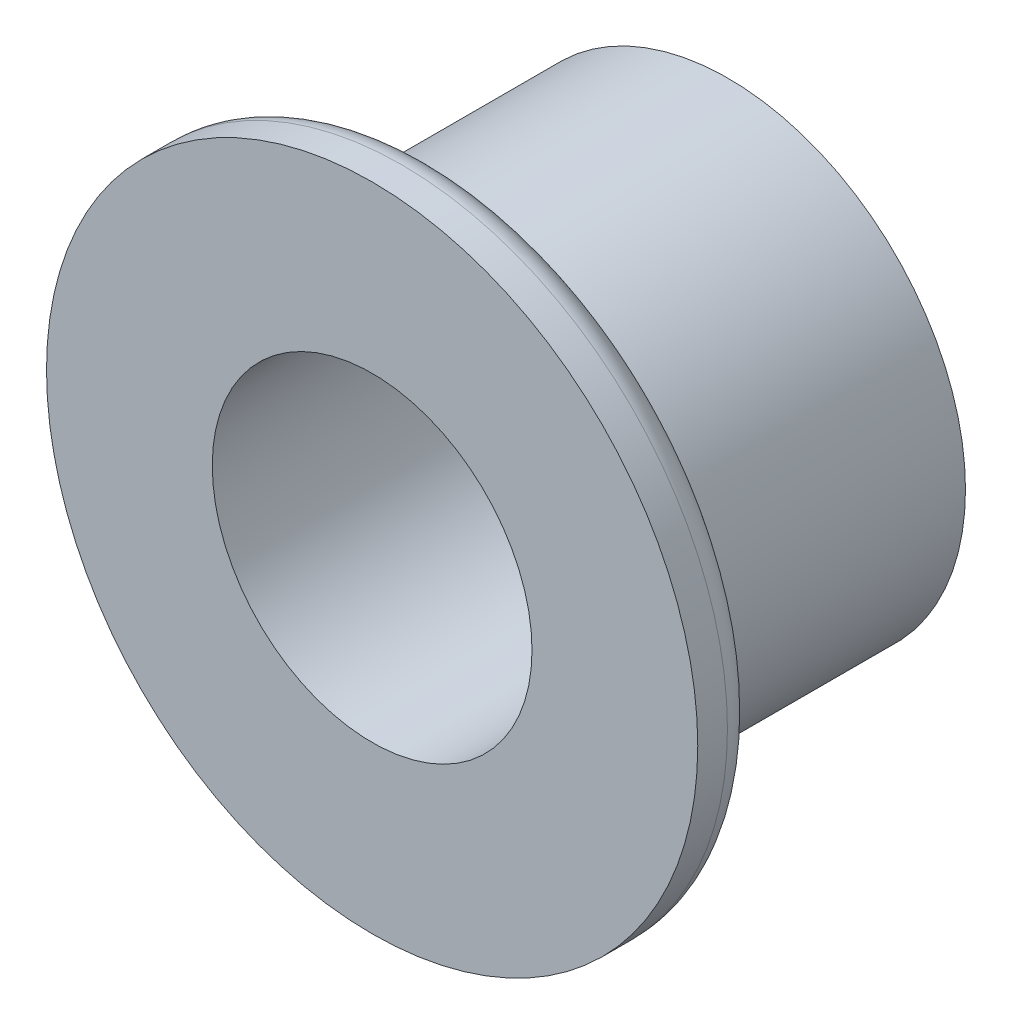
ISO-10303-21;
HEADER;
FILE_DESCRIPTION(('STEP AP214'),'2;1');
FILE_NAME('part.step','',(''),(''),'','','');
FILE_SCHEMA(('AUTOMOTIVE_DESIGN { 1 0 10303 214 1 1 1 1 }'));
ENDSEC;
DATA;
#1=APPLICATION_CONTEXT('core data for automotive mechanical design processes');
#2=APPLICATION_PROTOCOL_DEFINITION('international standard','automotive_design',2000,#1);
#3=PRODUCT_CONTEXT('',#1,'mechanical');
#4=PRODUCT('Part','Part','',(#3));
#5=PRODUCT_RELATED_PRODUCT_CATEGORY('part','',(#4));
#6=PRODUCT_DEFINITION_FORMATION('','',#4);
#7=PRODUCT_DEFINITION_CONTEXT('part definition',#1,'design');
#8=PRODUCT_DEFINITION('design','',#6,#7);
#9=PRODUCT_DEFINITION_SHAPE('','',#8);
#10=(LENGTH_UNIT() NAMED_UNIT(*) SI_UNIT(.MILLI.,.METRE.));
#11=(NAMED_UNIT(*) PLANE_ANGLE_UNIT() SI_UNIT($,.RADIAN.));
#12=(NAMED_UNIT(*) SI_UNIT($,.STERADIAN.) SOLID_ANGLE_UNIT());
#13=UNCERTAINTY_MEASURE_WITH_UNIT(LENGTH_MEASURE(1.E-05),#10,'distance_accuracy_value','');
#14=(GEOMETRIC_REPRESENTATION_CONTEXT(3) GLOBAL_UNCERTAINTY_ASSIGNED_CONTEXT((#13)) GLOBAL_UNIT_ASSIGNED_CONTEXT((#10,
#11,#12)) REPRESENTATION_CONTEXT('',''));
#15=CARTESIAN_POINT('',(0.,0.,0.));
#16=DIRECTION('',(0.,0.,1.));
#17=DIRECTION('',(1.,0.,0.));
#18=AXIS2_PLACEMENT_3D('',#15,#16,#17);
#19=CARTESIAN_POINT('',(0.,0.,0.));
#20=DIRECTION('',(0.,0.,1.));
#21=DIRECTION('',(1.,0.,0.));
#22=AXIS2_PLACEMENT_3D('',#19,#20,#21);
#23=PLANE('',#22);
#24=CARTESIAN_POINT('',(0.,0.,0.));
#25=DIRECTION('',(0.,0.,1.));
#26=DIRECTION('',(1.,0.,0.));
#27=AXIS2_PLACEMENT_3D('',#24,#25,#26);
#28=CIRCLE('',#27,5.08);
#29=CARTESIAN_POINT('',(5.08,0.,0.));
#30=VERTEX_POINT('',#29);
#31=EDGE_CURVE('E50',#30,#30,#28,.T.);
#32=ORIENTED_EDGE('',*,*,#31,.F.);
#33=EDGE_LOOP('',(#32));
#34=FACE_BOUND('',#33,.T.);
#35=CARTESIAN_POINT('',(0.,0.,0.));
#36=DIRECTION('',(0.,0.,1.));
#37=DIRECTION('',(1.,0.,0.));
#38=AXIS2_PLACEMENT_3D('',#35,#36,#37);
#39=CIRCLE('',#38,3.42202449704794);
#40=CARTESIAN_POINT('',(3.42202449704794,0.,0.));
#41=VERTEX_POINT('',#40);
#42=EDGE_CURVE('E53',#41,#41,#39,.T.);
#43=ORIENTED_EDGE('',*,*,#42,.T.);
#44=EDGE_LOOP('',(#43));
#45=FACE_BOUND('',#44,.T.);
#46=ADVANCED_FACE('F30',(#34,#45),#23,.F.);
#47=CARTESIAN_POINT('',(0.,0.,6.35));
#48=DIRECTION('',(0.,0.,-1.));
#49=DIRECTION('',(-1.,0.,0.));
#50=AXIS2_PLACEMENT_3D('',#47,#48,#49);
#51=CYLINDRICAL_SURFACE('',#50,5.08);
#52=CARTESIAN_POINT('',(0.,0.,5.715));
#53=DIRECTION('',(0.,0.,1.));
#54=DIRECTION('',(1.,0.,0.));
#55=AXIS2_PLACEMENT_3D('',#52,#53,#54);
#56=CIRCLE('',#55,5.08);
#57=CARTESIAN_POINT('',(5.08,0.,5.715));
#58=VERTEX_POINT('',#57);
#59=EDGE_CURVE('E10',#58,#58,#56,.F.);
#60=ORIENTED_EDGE('',*,*,#59,.T.);
#61=EDGE_LOOP('',(#60));
#62=FACE_BOUND('',#61,.T.);
#63=ORIENTED_EDGE('',*,*,#31,.T.);
#64=EDGE_LOOP('',(#63));
#65=FACE_BOUND('',#64,.T.);
#66=ADVANCED_FACE('F80',(#62,#65),#51,.T.);
#67=CARTESIAN_POINT('',(0.,0.,6.35));
#68=DIRECTION('',(0.,0.,-1.));
#69=DIRECTION('',(-1.,0.,0.));
#70=AXIS2_PLACEMENT_3D('',#67,#68,#69);
#71=CYLINDRICAL_SURFACE('',#70,3.42202449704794);
#72=ORIENTED_EDGE('',*,*,#42,.F.);
#73=EDGE_LOOP('',(#72));
#74=FACE_BOUND('',#73,.T.);
#75=CARTESIAN_POINT('',(0.,0.,7.62));
#76=DIRECTION('',(0.,0.,1.));
#77=DIRECTION('',(1.,0.,0.));
#78=AXIS2_PLACEMENT_3D('',#75,#76,#77);
#79=CIRCLE('',#78,3.42202449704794);
#80=CARTESIAN_POINT('',(3.42202449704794,0.,7.62));
#81=VERTEX_POINT('',#80);
#82=EDGE_CURVE('E59',#81,#81,#79,.T.);
#83=ORIENTED_EDGE('',*,*,#82,.T.);
#84=EDGE_LOOP('',(#83));
#85=FACE_BOUND('',#84,.T.);
#86=ADVANCED_FACE('F63',(#74,#85),#71,.F.);
#87=CARTESIAN_POINT('',(0.,0.,6.35));
#88=DIRECTION('',(0.,0.,1.));
#89=DIRECTION('',(1.,0.,0.));
#90=AXIS2_PLACEMENT_3D('',#87,#88,#89);
#91=PLANE('',#90);
#92=CARTESIAN_POINT('',(0.,0.,6.35));
#93=DIRECTION('',(0.,0.,1.));
#94=DIRECTION('',(1.,0.,0.));
#95=AXIS2_PLACEMENT_3D('',#92,#93,#94);
#96=CIRCLE('',#95,6.33474540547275);
#97=CARTESIAN_POINT('',(6.33474540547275,0.,6.35));
#98=VERTEX_POINT('',#97);
#99=EDGE_CURVE('E37',#98,#98,#96,.F.);
#100=ORIENTED_EDGE('',*,*,#99,.T.);
#101=EDGE_LOOP('',(#100));
#102=FACE_BOUND('',#101,.T.);
#103=CARTESIAN_POINT('',(0.,0.,6.35));
#104=DIRECTION('',(0.,0.,1.));
#105=DIRECTION('',(1.,0.,0.));
#106=AXIS2_PLACEMENT_3D('',#103,#104,#105);
#107=CIRCLE('',#106,5.715);
#108=CARTESIAN_POINT('',(5.715,0.,6.35));
#109=VERTEX_POINT('',#108);
#110=EDGE_CURVE('E41',#109,#109,#107,.T.);
#111=ORIENTED_EDGE('',*,*,#110,.T.);
#112=EDGE_LOOP('',(#111));
#113=FACE_BOUND('',#112,.T.);
#114=ADVANCED_FACE('F68',(#102,#113),#91,.F.);
#115=CARTESIAN_POINT('',(0.,0.,7.62));
#116=DIRECTION('',(0.,0.,1.));
#117=DIRECTION('',(1.,0.,0.));
#118=AXIS2_PLACEMENT_3D('',#115,#116,#117);
#119=PLANE('',#118);
#120=CARTESIAN_POINT('',(0.,0.,7.62));
#121=DIRECTION('',(0.,0.,1.));
#122=DIRECTION('',(1.,0.,0.));
#123=AXIS2_PLACEMENT_3D('',#120,#121,#122);
#124=CIRCLE('',#123,6.96974540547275);
#125=CARTESIAN_POINT('',(6.96974540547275,0.,7.62));
#126=VERTEX_POINT('',#125);
#127=EDGE_CURVE('E56',#126,#126,#124,.T.);
#128=ORIENTED_EDGE('',*,*,#127,.T.);
#129=EDGE_LOOP('',(#128));
#130=FACE_BOUND('',#129,.T.);
#131=ORIENTED_EDGE('',*,*,#82,.F.);
#132=EDGE_LOOP('',(#131));
#133=FACE_BOUND('',#132,.T.);
#134=ADVANCED_FACE('F65',(#130,#133),#119,.T.);
#135=CARTESIAN_POINT('',(0.,0.,7.62));
#136=DIRECTION('',(0.,0.,-1.));
#137=DIRECTION('',(-1.,0.,0.));
#138=AXIS2_PLACEMENT_3D('',#135,#136,#137);
#139=CYLINDRICAL_SURFACE('',#138,6.96974540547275);
#140=CARTESIAN_POINT('',(0.,0.,6.985));
#141=DIRECTION('',(0.,0.,1.));
#142=DIRECTION('',(1.,0.,0.));
#143=AXIS2_PLACEMENT_3D('',#140,#141,#142);
#144=CIRCLE('',#143,6.96974540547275);
#145=CARTESIAN_POINT('',(6.96974540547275,0.,6.985));
#146=VERTEX_POINT('',#145);
#147=EDGE_CURVE('E45',#146,#146,#144,.T.);
#148=ORIENTED_EDGE('',*,*,#147,.T.);
#149=EDGE_LOOP('',(#148));
#150=FACE_BOUND('',#149,.T.);
#151=ORIENTED_EDGE('',*,*,#127,.F.);
#152=EDGE_LOOP('',(#151));
#153=FACE_BOUND('',#152,.T.);
#154=ADVANCED_FACE('F67',(#150,#153),#139,.T.);
#155=CARTESIAN_POINT('',(0.,0.,6.985));
#156=DIRECTION('',(0.,0.,1.));
#157=DIRECTION('',(1.,0.,0.));
#158=AXIS2_PLACEMENT_3D('',#155,#156,#157);
#159=TOROIDAL_SURFACE('',#158,6.33474540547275,0.635);
#160=ORIENTED_EDGE('',*,*,#99,.F.);
#161=EDGE_LOOP('',(#160));
#162=FACE_BOUND('',#161,.T.);
#163=ORIENTED_EDGE('',*,*,#147,.F.);
#164=EDGE_LOOP('',(#163));
#165=FACE_BOUND('',#164,.T.);
#166=ADVANCED_FACE('F75',(#162,#165),#159,.T.);
#167=CARTESIAN_POINT('',(0.,0.,5.715));
#168=DIRECTION('',(0.,0.,1.));
#169=DIRECTION('',(1.,0.,0.));
#170=AXIS2_PLACEMENT_3D('',#167,#168,#169);
#171=TOROIDAL_SURFACE('',#170,5.715,0.635);
#172=ORIENTED_EDGE('',*,*,#59,.F.);
#173=EDGE_LOOP('',(#172));
#174=FACE_BOUND('',#173,.T.);
#175=ORIENTED_EDGE('',*,*,#110,.F.);
#176=EDGE_LOOP('',(#175));
#177=FACE_BOUND('',#176,.T.);
#178=ADVANCED_FACE('F32',(#174,#177),#171,.F.);
#179=CLOSED_SHELL('',(#46,#66,#86,#114,#134,#154,#166,#178));
#180=MANIFOLD_SOLID_BREP('B2',#179);
#181=ADVANCED_BREP_SHAPE_REPRESENTATION('',(#18,#180),#14);
#182=SHAPE_DEFINITION_REPRESENTATION(#9,#181);
ENDSEC;
END-ISO-10303-21;
